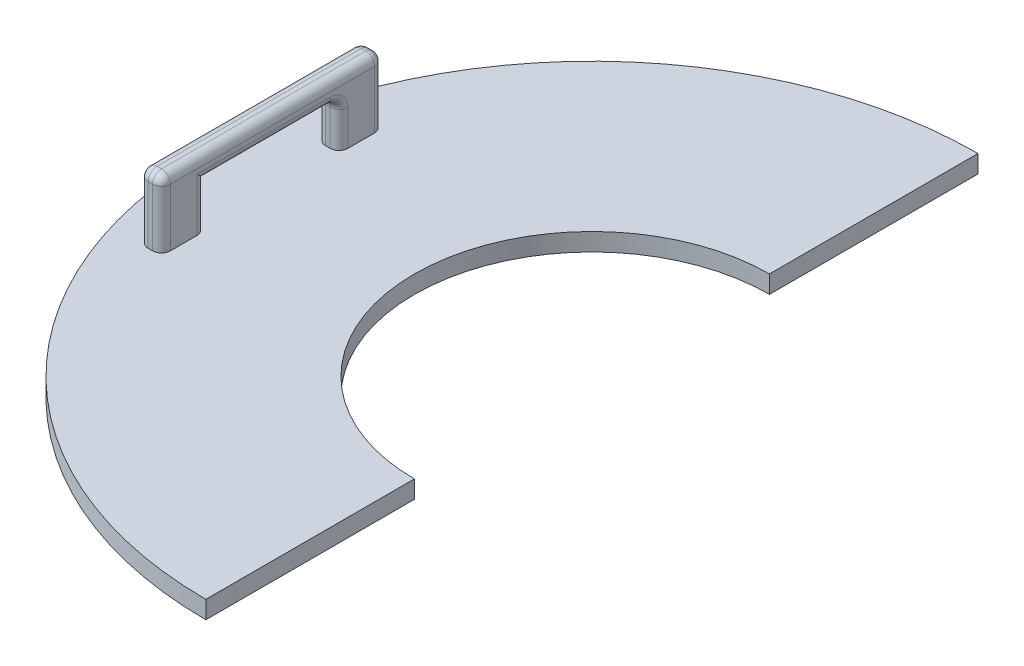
from build123d import *

# Parameters (mm, degrees)
BOSS_EXTRUDE1_DEPTH = 4
SKETCH2_W           = 5
SKETCH2_H           = 10
BOSS_EXTRUDE2_DEPTH = 15
BOSS_EXTRUDE3_REACH = 137.403
SKETCH3_W           = 5
SKETCH3_H           = 5
FILLET1_R           = 2


with BuildPart() as part:
    # Sketch1 → Boss-Extrude1 (new body)
    with BuildSketch(Plane(origin=(0, 0, 0), x_dir=(1, 0, 0), z_dir=(0, 1, 0))):
        with BuildLine():
            Line((0, 87), (0, 40))
            ThreePointArc((0, 40), (-40, 0), (0, -40))
            Line((0, -40), (0, -87))
            ThreePointArc((0, -87), (-87, 0), (0, 87))
        make_face()
    extrude(amount=BOSS_EXTRUDE1_DEPTH)

    # Sketch2 → Boss-Extrude2 (add)
    with BuildSketch(Plane(origin=(0, 4, 0), x_dir=(1, 0, 0), z_dir=(0, 1, 0))):
        with Locations((-74.5, -20)):
            Rectangle(SKETCH2_W, SKETCH2_H)
        with Locations((-74.5, 20)):
            Rectangle(SKETCH2_W, SKETCH2_H)
    extrude(amount=BOSS_EXTRUDE2_DEPTH)

    # Sketch3 → Boss-Extrude3 (add, up to next)
    with BuildSketch(Plane.XY.offset(-15), mode=Mode.PRIVATE) as boss_extrude3_sk1:
        with Locations((-74.5, 16.5)):
            Rectangle(SKETCH3_W, SKETCH3_H)
    boss_extrude3_tool1 = extrude(boss_extrude3_sk1.sketch, amount=BOSS_EXTRUDE3_REACH, mode=Mode.PRIVATE) - part.part
    add(boss_extrude3_tool1.solids().sort_by_distance((-74.5, 16.5, -15))[0])

    # Fillet1
    fillet1_edges = [part.edges().sort_by_distance(p)[0] for p in [
        (-77, 11.5, 25),
        (-72, 11.5, 25),
        (-77, 19, 0),
        (-74.5, 19, 25),
        (-72, 19, 0),
        (-77, 11.5, -25),
        (-72, 11.5, -25),
        (-74.5, 19, -25),
        (-72, 9, -15),
        (-77, 9, -15),
        (-77, 9, 15),
        (-72, 9, 15),
        (-72, 14, 0),
        (-77, 14, 0),
        (-74.5, 14, -15),
    ]]
    fillet(fillet1_edges, radius=FILLET1_R)


solid = part.part
